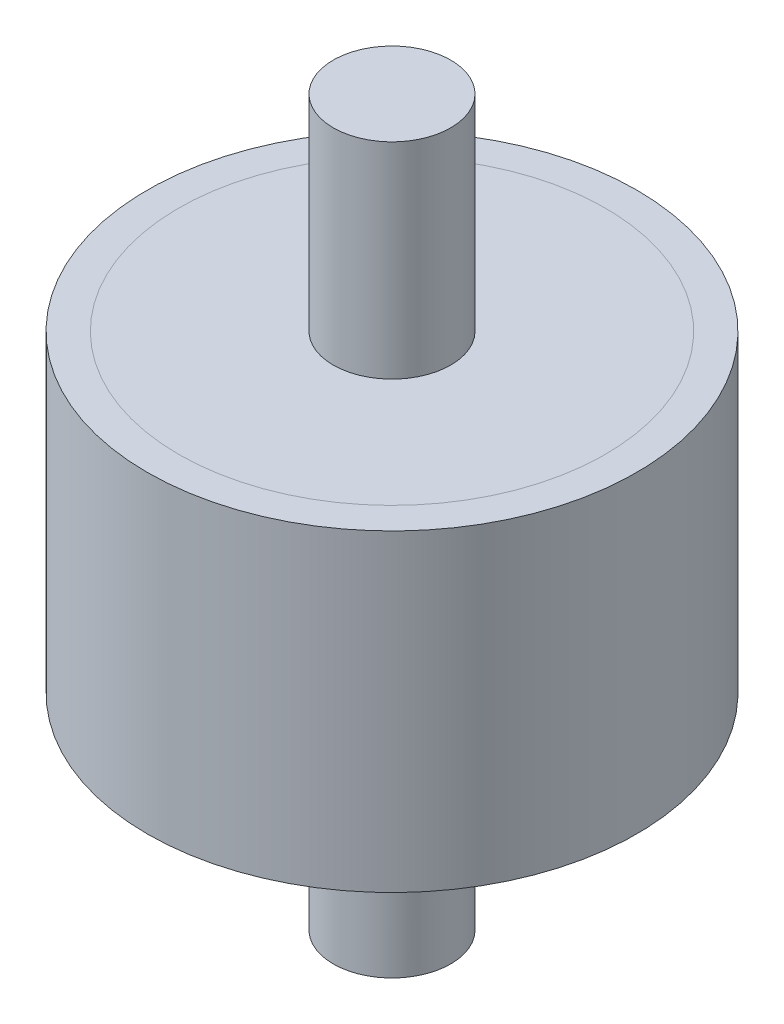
from build123d import *

# Parameters (mm, degrees)
SKETCH2_W = 19.84375
SKETCH2_H = 25.4
SKETCH6_W = 4.7625
SKETCH6_H = 16.66875


with BuildPart() as part:
    # Sketch2 → Revolve1 (revolve)
    with BuildSketch(Plane.XY, mode=Mode.PRIVATE) as revolve1_sk:
        with Locations((-9.921875, 0)):
            Rectangle(SKETCH2_W, SKETCH2_H)
    revolve(revolve1_sk.sketch.rotate(Axis((0, 83.524338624, 0), (0, -1, 0)), 270), axis=Axis((0, 83.524338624, 0), (0, -1, 0)))

    # Sketch6 → Revolve2 (revolve)
    with BuildSketch(Plane.XY, mode=Mode.PRIVATE) as revolve2_sk:
        with Locations((-2.38125, 21.034375)):
            Rectangle(SKETCH6_W, SKETCH6_H)
        with Locations((-2.38125, -21.034375)):
            Rectangle(SKETCH6_W, SKETCH6_H)
    revolve(revolve2_sk.sketch.rotate(Axis((0, 26.309371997, 0), (0, -1, 0)), 270), axis=Axis((0, 26.309371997, 0), (0, -1, 0)))


solid = part.part
